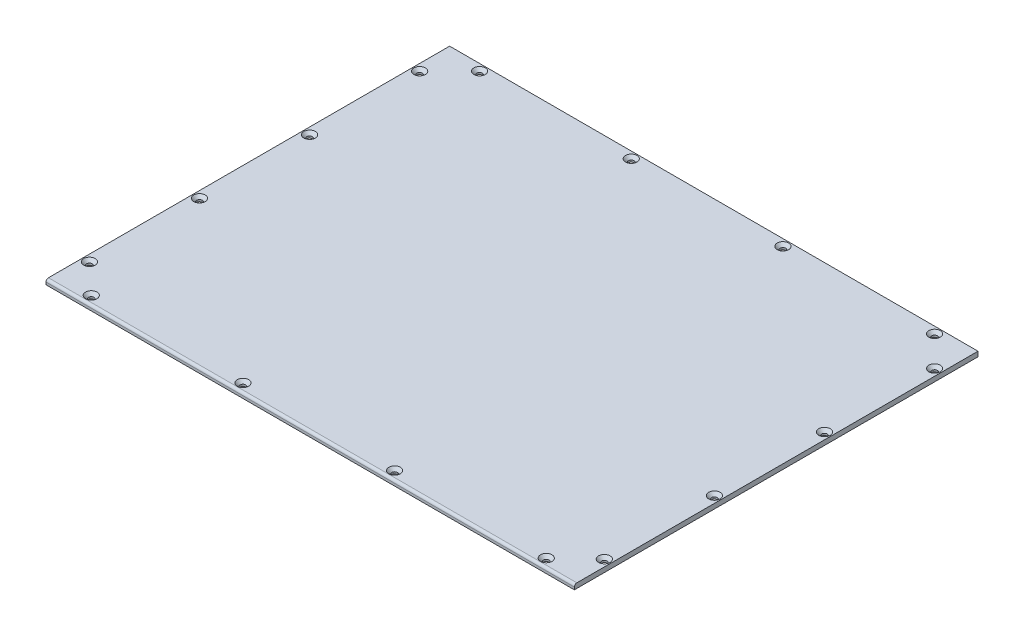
ISO-10303-21;
HEADER;
FILE_DESCRIPTION(('STEP AP214'),'2;1');
FILE_NAME('part.step','',(''),(''),'','','');
FILE_SCHEMA(('AUTOMOTIVE_DESIGN { 1 0 10303 214 1 1 1 1 }'));
ENDSEC;
DATA;
#1=APPLICATION_CONTEXT('core data for automotive mechanical design processes');
#2=APPLICATION_PROTOCOL_DEFINITION('international standard','automotive_design',2000,#1);
#3=PRODUCT_CONTEXT('',#1,'mechanical');
#4=PRODUCT('Part','Part','',(#3));
#5=PRODUCT_RELATED_PRODUCT_CATEGORY('part','',(#4));
#6=PRODUCT_DEFINITION_FORMATION('','',#4);
#7=PRODUCT_DEFINITION_CONTEXT('part definition',#1,'design');
#8=PRODUCT_DEFINITION('design','',#6,#7);
#9=PRODUCT_DEFINITION_SHAPE('','',#8);
#10=(LENGTH_UNIT() NAMED_UNIT(*) SI_UNIT(.MILLI.,.METRE.));
#11=(NAMED_UNIT(*) PLANE_ANGLE_UNIT() SI_UNIT($,.RADIAN.));
#12=(NAMED_UNIT(*) SI_UNIT($,.STERADIAN.) SOLID_ANGLE_UNIT());
#13=UNCERTAINTY_MEASURE_WITH_UNIT(LENGTH_MEASURE(1.E-05),#10,'distance_accuracy_value','');
#14=(GEOMETRIC_REPRESENTATION_CONTEXT(3) GLOBAL_UNCERTAINTY_ASSIGNED_CONTEXT((#13)) GLOBAL_UNIT_ASSIGNED_CONTEXT((#10,
#11,#12)) REPRESENTATION_CONTEXT('',''));
#15=CARTESIAN_POINT('',(0.,0.,0.));
#16=DIRECTION('',(0.,0.,1.));
#17=DIRECTION('',(1.,0.,0.));
#18=AXIS2_PLACEMENT_3D('',#15,#16,#17);
#19=CARTESIAN_POINT('',(0.,0.,0.));
#20=DIRECTION('',(0.,-1.,0.));
#21=DIRECTION('',(0.,0.,-1.));
#22=AXIS2_PLACEMENT_3D('',#19,#20,#21);
#23=PLANE('',#22);
#24=CARTESIAN_POINT('',(30.,0.,-324.5));
#25=DIRECTION('',(0.,1.,0.));
#26=DIRECTION('',(0.,0.,1.));
#27=AXIS2_PLACEMENT_3D('',#24,#25,#26);
#28=CIRCLE('',#27,2.25);
#29=CARTESIAN_POINT('',(30.,0.,-322.25));
#30=VERTEX_POINT('',#29);
#31=EDGE_CURVE('E262',#30,#30,#28,.T.);
#32=ORIENTED_EDGE('',*,*,#31,.T.);
#33=EDGE_LOOP('',(#32));
#34=FACE_BOUND('',#33,.T.);
#35=CARTESIAN_POINT('',(154.,0.,-324.5));
#36=DIRECTION('',(0.,1.,0.));
#37=DIRECTION('',(0.,0.,1.));
#38=AXIS2_PLACEMENT_3D('',#35,#36,#37);
#39=CIRCLE('',#38,2.25);
#40=CARTESIAN_POINT('',(154.,0.,-322.25));
#41=VERTEX_POINT('',#40);
#42=EDGE_CURVE('E253',#41,#41,#39,.T.);
#43=ORIENTED_EDGE('',*,*,#42,.T.);
#44=EDGE_LOOP('',(#43));
#45=FACE_BOUND('',#44,.T.);
#46=DIRECTION('',(0.,0.,1.));
#47=VECTOR('',#46,1.);
#48=CARTESIAN_POINT('',(0.,0.,0.));
#49=LINE('',#48,#47);
#50=CARTESIAN_POINT('',(0.,0.,-330.));
#51=VERTEX_POINT('',#50);
#52=CARTESIAN_POINT('',(0.,0.,0.));
#53=VERTEX_POINT('',#52);
#54=EDGE_CURVE('E105',#51,#53,#49,.T.);
#55=ORIENTED_EDGE('',*,*,#54,.F.);
#56=DIRECTION('',(-1.,0.,0.));
#57=VECTOR('',#56,1.);
#58=CARTESIAN_POINT('',(0.,0.,-330.));
#59=LINE('',#58,#57);
#60=CARTESIAN_POINT('',(432.,0.,-330.));
#61=VERTEX_POINT('',#60);
#62=EDGE_CURVE('E113',#61,#51,#59,.T.);
#63=ORIENTED_EDGE('',*,*,#62,.F.);
#64=DIRECTION('',(0.,0.,-1.));
#65=VECTOR('',#64,1.);
#66=CARTESIAN_POINT('',(432.,0.,0.));
#67=LINE('',#66,#65);
#68=CARTESIAN_POINT('',(432.,0.,0.));
#69=VERTEX_POINT('',#68);
#70=EDGE_CURVE('E92',#69,#61,#67,.T.);
#71=ORIENTED_EDGE('',*,*,#70,.F.);
#72=DIRECTION('',(1.,0.,0.));
#73=VECTOR('',#72,1.);
#74=CARTESIAN_POINT('',(0.,0.,0.));
#75=LINE('',#74,#73);
#76=EDGE_CURVE('E108',#53,#69,#75,.T.);
#77=ORIENTED_EDGE('',*,*,#76,.F.);
#78=EDGE_LOOP('',(#55,#63,#71,#77));
#79=FACE_BOUND('',#78,.T.);
#80=CARTESIAN_POINT('',(5.5,0.,-300.));
#81=DIRECTION('',(0.,1.,0.));
#82=DIRECTION('',(0.,0.,1.));
#83=AXIS2_PLACEMENT_3D('',#80,#81,#82);
#84=CIRCLE('',#83,2.25);
#85=CARTESIAN_POINT('',(5.5,0.,-297.75));
#86=VERTEX_POINT('',#85);
#87=EDGE_CURVE('E109',#86,#86,#84,.T.);
#88=ORIENTED_EDGE('',*,*,#87,.T.);
#89=EDGE_LOOP('',(#88));
#90=FACE_BOUND('',#89,.T.);
#91=CARTESIAN_POINT('',(5.5,0.,-210.));
#92=DIRECTION('',(0.,1.,0.));
#93=DIRECTION('',(0.,0.,1.));
#94=AXIS2_PLACEMENT_3D('',#91,#92,#93);
#95=CIRCLE('',#94,2.25);
#96=CARTESIAN_POINT('',(5.5,0.,-207.75));
#97=VERTEX_POINT('',#96);
#98=EDGE_CURVE('E136',#97,#97,#95,.T.);
#99=ORIENTED_EDGE('',*,*,#98,.T.);
#100=EDGE_LOOP('',(#99));
#101=FACE_BOUND('',#100,.T.);
#102=CARTESIAN_POINT('',(5.5,0.,-120.));
#103=DIRECTION('',(0.,1.,0.));
#104=DIRECTION('',(0.,0.,1.));
#105=AXIS2_PLACEMENT_3D('',#102,#103,#104);
#106=CIRCLE('',#105,2.25);
#107=CARTESIAN_POINT('',(5.5,0.,-117.75));
#108=VERTEX_POINT('',#107);
#109=EDGE_CURVE('E145',#108,#108,#106,.T.);
#110=ORIENTED_EDGE('',*,*,#109,.T.);
#111=EDGE_LOOP('',(#110));
#112=FACE_BOUND('',#111,.T.);
#113=CARTESIAN_POINT('',(5.5,0.,-30.0000000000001));
#114=DIRECTION('',(0.,1.,0.));
#115=DIRECTION('',(0.,0.,1.));
#116=AXIS2_PLACEMENT_3D('',#113,#114,#115);
#117=CIRCLE('',#116,2.25);
#118=CARTESIAN_POINT('',(5.5,0.,-27.7500000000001));
#119=VERTEX_POINT('',#118);
#120=EDGE_CURVE('E154',#119,#119,#117,.T.);
#121=ORIENTED_EDGE('',*,*,#120,.T.);
#122=EDGE_LOOP('',(#121));
#123=FACE_BOUND('',#122,.T.);
#124=CARTESIAN_POINT('',(30.,0.,-7.));
#125=DIRECTION('',(0.,1.,0.));
#126=DIRECTION('',(0.,0.,1.));
#127=AXIS2_PLACEMENT_3D('',#124,#125,#126);
#128=CIRCLE('',#127,2.25);
#129=CARTESIAN_POINT('',(30.,0.,-4.75));
#130=VERTEX_POINT('',#129);
#131=EDGE_CURVE('E163',#130,#130,#128,.T.);
#132=ORIENTED_EDGE('',*,*,#131,.T.);
#133=EDGE_LOOP('',(#132));
#134=FACE_BOUND('',#133,.T.);
#135=CARTESIAN_POINT('',(154.,0.,-7.));
#136=DIRECTION('',(0.,1.,0.));
#137=DIRECTION('',(0.,0.,1.));
#138=AXIS2_PLACEMENT_3D('',#135,#136,#137);
#139=CIRCLE('',#138,2.25);
#140=CARTESIAN_POINT('',(154.,0.,-4.75));
#141=VERTEX_POINT('',#140);
#142=EDGE_CURVE('E172',#141,#141,#139,.T.);
#143=ORIENTED_EDGE('',*,*,#142,.T.);
#144=EDGE_LOOP('',(#143));
#145=FACE_BOUND('',#144,.T.);
#146=CARTESIAN_POINT('',(278.,0.,-7.));
#147=DIRECTION('',(0.,1.,0.));
#148=DIRECTION('',(0.,0.,1.));
#149=AXIS2_PLACEMENT_3D('',#146,#147,#148);
#150=CIRCLE('',#149,2.24999999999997);
#151=CARTESIAN_POINT('',(278.,0.,-4.75000000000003));
#152=VERTEX_POINT('',#151);
#153=EDGE_CURVE('E181',#152,#152,#150,.T.);
#154=ORIENTED_EDGE('',*,*,#153,.T.);
#155=EDGE_LOOP('',(#154));
#156=FACE_BOUND('',#155,.T.);
#157=CARTESIAN_POINT('',(402.,0.,-7.));
#158=DIRECTION('',(0.,1.,0.));
#159=DIRECTION('',(0.,0.,1.));
#160=AXIS2_PLACEMENT_3D('',#157,#158,#159);
#161=CIRCLE('',#160,2.24999999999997);
#162=CARTESIAN_POINT('',(402.,0.,-4.75000000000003));
#163=VERTEX_POINT('',#162);
#164=EDGE_CURVE('E190',#163,#163,#161,.T.);
#165=ORIENTED_EDGE('',*,*,#164,.T.);
#166=EDGE_LOOP('',(#165));
#167=FACE_BOUND('',#166,.T.);
#168=CARTESIAN_POINT('',(426.5,0.,-30.0000000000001));
#169=DIRECTION('',(0.,1.,0.));
#170=DIRECTION('',(0.,0.,1.));
#171=AXIS2_PLACEMENT_3D('',#168,#169,#170);
#172=CIRCLE('',#171,2.24999999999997);
#173=CARTESIAN_POINT('',(426.5,0.,-27.7500000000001));
#174=VERTEX_POINT('',#173);
#175=EDGE_CURVE('E199',#174,#174,#172,.T.);
#176=ORIENTED_EDGE('',*,*,#175,.T.);
#177=EDGE_LOOP('',(#176));
#178=FACE_BOUND('',#177,.T.);
#179=CARTESIAN_POINT('',(426.5,0.,-120.));
#180=DIRECTION('',(0.,1.,0.));
#181=DIRECTION('',(0.,0.,1.));
#182=AXIS2_PLACEMENT_3D('',#179,#180,#181);
#183=CIRCLE('',#182,2.24999999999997);
#184=CARTESIAN_POINT('',(426.5,0.,-117.75));
#185=VERTEX_POINT('',#184);
#186=EDGE_CURVE('E208',#185,#185,#183,.T.);
#187=ORIENTED_EDGE('',*,*,#186,.T.);
#188=EDGE_LOOP('',(#187));
#189=FACE_BOUND('',#188,.T.);
#190=CARTESIAN_POINT('',(426.5,0.,-210.));
#191=DIRECTION('',(0.,1.,0.));
#192=DIRECTION('',(0.,0.,1.));
#193=AXIS2_PLACEMENT_3D('',#190,#191,#192);
#194=CIRCLE('',#193,2.24999999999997);
#195=CARTESIAN_POINT('',(426.5,0.,-207.75));
#196=VERTEX_POINT('',#195);
#197=EDGE_CURVE('E217',#196,#196,#194,.T.);
#198=ORIENTED_EDGE('',*,*,#197,.T.);
#199=EDGE_LOOP('',(#198));
#200=FACE_BOUND('',#199,.T.);
#201=CARTESIAN_POINT('',(426.5,0.,-300.));
#202=DIRECTION('',(0.,1.,0.));
#203=DIRECTION('',(0.,0.,1.));
#204=AXIS2_PLACEMENT_3D('',#201,#202,#203);
#205=CIRCLE('',#204,2.24999999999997);
#206=CARTESIAN_POINT('',(426.5,0.,-297.75));
#207=VERTEX_POINT('',#206);
#208=EDGE_CURVE('E226',#207,#207,#205,.T.);
#209=ORIENTED_EDGE('',*,*,#208,.T.);
#210=EDGE_LOOP('',(#209));
#211=FACE_BOUND('',#210,.T.);
#212=CARTESIAN_POINT('',(402.,0.,-324.5));
#213=DIRECTION('',(0.,1.,0.));
#214=DIRECTION('',(0.,0.,1.));
#215=AXIS2_PLACEMENT_3D('',#212,#213,#214);
#216=CIRCLE('',#215,2.24999999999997);
#217=CARTESIAN_POINT('',(402.,0.,-322.25));
#218=VERTEX_POINT('',#217);
#219=EDGE_CURVE('E235',#218,#218,#216,.T.);
#220=ORIENTED_EDGE('',*,*,#219,.T.);
#221=EDGE_LOOP('',(#220));
#222=FACE_BOUND('',#221,.T.);
#223=CARTESIAN_POINT('',(278.,0.,-324.5));
#224=DIRECTION('',(0.,1.,0.));
#225=DIRECTION('',(0.,0.,1.));
#226=AXIS2_PLACEMENT_3D('',#223,#224,#225);
#227=CIRCLE('',#226,2.24999999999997);
#228=CARTESIAN_POINT('',(278.,0.,-322.25));
#229=VERTEX_POINT('',#228);
#230=EDGE_CURVE('E244',#229,#229,#227,.T.);
#231=ORIENTED_EDGE('',*,*,#230,.T.);
#232=EDGE_LOOP('',(#231));
#233=FACE_BOUND('',#232,.T.);
#234=ADVANCED_FACE('F33',(#34,#45,#79,#90,#101,#112,#123,#134,#145,#156,#167,#178,#189,#200,
#211,#222,#233),#23,.T.);
#235=CARTESIAN_POINT('',(0.,4.,0.));
#236=DIRECTION('',(1.,0.,0.));
#237=DIRECTION('',(0.,0.,-1.));
#238=AXIS2_PLACEMENT_3D('',#235,#236,#237);
#239=PLANE('',#238);
#240=DIRECTION('',(0.,-1.,0.));
#241=VECTOR('',#240,1.);
#242=CARTESIAN_POINT('',(0.,4.,0.));
#243=LINE('',#242,#241);
#244=CARTESIAN_POINT('',(0.,2.,0.));
#245=VERTEX_POINT('',#244);
#246=EDGE_CURVE('E116',#245,#53,#243,.T.);
#247=ORIENTED_EDGE('',*,*,#246,.F.);
#248=CARTESIAN_POINT('',(0.,2.,-2.));
#249=DIRECTION('',(1.,0.,0.));
#250=DIRECTION('',(0.,0.,-1.));
#251=AXIS2_PLACEMENT_3D('',#248,#249,#250);
#252=CIRCLE('',#251,2.);
#253=CARTESIAN_POINT('',(0.,4.,-2.));
#254=VERTEX_POINT('',#253);
#255=EDGE_CURVE('E11',#245,#254,#252,.F.);
#256=ORIENTED_EDGE('',*,*,#255,.T.);
#257=DIRECTION('',(0.,0.,1.));
#258=VECTOR('',#257,1.);
#259=CARTESIAN_POINT('',(0.,4.,0.));
#260=LINE('',#259,#258);
#261=CARTESIAN_POINT('',(0.,4.,-330.));
#262=VERTEX_POINT('',#261);
#263=EDGE_CURVE('E86',#262,#254,#260,.T.);
#264=ORIENTED_EDGE('',*,*,#263,.F.);
#265=DIRECTION('',(0.,-1.,0.));
#266=VECTOR('',#265,1.);
#267=CARTESIAN_POINT('',(0.,4.,-330.));
#268=LINE('',#267,#266);
#269=EDGE_CURVE('E96',#262,#51,#268,.T.);
#270=ORIENTED_EDGE('',*,*,#269,.T.);
#271=ORIENTED_EDGE('',*,*,#54,.T.);
#272=EDGE_LOOP('',(#247,#256,#264,#270,#271));
#273=FACE_BOUND('',#272,.T.);
#274=ADVANCED_FACE('F126',(#273),#239,.F.);
#275=CARTESIAN_POINT('',(0.,4.,0.));
#276=DIRECTION('',(0.,0.,-1.));
#277=DIRECTION('',(-1.,0.,0.));
#278=AXIS2_PLACEMENT_3D('',#275,#276,#277);
#279=PLANE('',#278);
#280=DIRECTION('',(0.,-1.,0.));
#281=VECTOR('',#280,1.);
#282=CARTESIAN_POINT('',(432.,4.,0.));
#283=LINE('',#282,#281);
#284=CARTESIAN_POINT('',(432.,2.,0.));
#285=VERTEX_POINT('',#284);
#286=EDGE_CURVE('E95',#285,#69,#283,.T.);
#287=ORIENTED_EDGE('',*,*,#286,.F.);
#288=DIRECTION('',(1.,0.,0.));
#289=VECTOR('',#288,1.);
#290=CARTESIAN_POINT('',(0.,2.,0.));
#291=LINE('',#290,#289);
#292=EDGE_CURVE('E41',#285,#245,#291,.F.);
#293=ORIENTED_EDGE('',*,*,#292,.T.);
#294=ORIENTED_EDGE('',*,*,#246,.T.);
#295=ORIENTED_EDGE('',*,*,#76,.T.);
#296=EDGE_LOOP('',(#287,#293,#294,#295));
#297=FACE_BOUND('',#296,.T.);
#298=ADVANCED_FACE('F120',(#297),#279,.F.);
#299=CARTESIAN_POINT('',(432.,4.,0.));
#300=DIRECTION('',(-1.,0.,0.));
#301=DIRECTION('',(0.,0.,1.));
#302=AXIS2_PLACEMENT_3D('',#299,#300,#301);
#303=PLANE('',#302);
#304=DIRECTION('',(0.,0.,-1.));
#305=VECTOR('',#304,1.);
#306=CARTESIAN_POINT('',(432.,4.,0.));
#307=LINE('',#306,#305);
#308=CARTESIAN_POINT('',(432.,4.,-2.));
#309=VERTEX_POINT('',#308);
#310=CARTESIAN_POINT('',(432.,4.,-330.));
#311=VERTEX_POINT('',#310);
#312=EDGE_CURVE('E77',#309,#311,#307,.T.);
#313=ORIENTED_EDGE('',*,*,#312,.F.);
#314=CARTESIAN_POINT('',(432.,2.,-2.));
#315=DIRECTION('',(-1.,0.,0.));
#316=DIRECTION('',(0.,0.,1.));
#317=AXIS2_PLACEMENT_3D('',#314,#315,#316);
#318=CIRCLE('',#317,2.);
#319=EDGE_CURVE('E55',#309,#285,#318,.F.);
#320=ORIENTED_EDGE('',*,*,#319,.T.);
#321=ORIENTED_EDGE('',*,*,#286,.T.);
#322=ORIENTED_EDGE('',*,*,#70,.T.);
#323=DIRECTION('',(0.,-1.,0.));
#324=VECTOR('',#323,1.);
#325=CARTESIAN_POINT('',(432.,4.,-330.));
#326=LINE('',#325,#324);
#327=EDGE_CURVE('E89',#311,#61,#326,.T.);
#328=ORIENTED_EDGE('',*,*,#327,.F.);
#329=EDGE_LOOP('',(#313,#320,#321,#322,#328));
#330=FACE_BOUND('',#329,.T.);
#331=ADVANCED_FACE('F90',(#330),#303,.F.);
#332=CARTESIAN_POINT('',(0.,4.,-330.));
#333=DIRECTION('',(0.,0.,1.));
#334=DIRECTION('',(1.,0.,0.));
#335=AXIS2_PLACEMENT_3D('',#332,#333,#334);
#336=PLANE('',#335);
#337=ORIENTED_EDGE('',*,*,#62,.T.);
#338=ORIENTED_EDGE('',*,*,#269,.F.);
#339=DIRECTION('',(-1.,0.,0.));
#340=VECTOR('',#339,1.);
#341=CARTESIAN_POINT('',(0.,4.,-330.));
#342=LINE('',#341,#340);
#343=EDGE_CURVE('E82',#311,#262,#342,.T.);
#344=ORIENTED_EDGE('',*,*,#343,.F.);
#345=ORIENTED_EDGE('',*,*,#327,.T.);
#346=EDGE_LOOP('',(#337,#338,#344,#345));
#347=FACE_BOUND('',#346,.T.);
#348=ADVANCED_FACE('F98',(#347),#336,.F.);
#349=CARTESIAN_POINT('',(0.,4.,0.));
#350=DIRECTION('',(0.,-1.,0.));
#351=DIRECTION('',(0.,0.,-1.));
#352=AXIS2_PLACEMENT_3D('',#349,#350,#351);
#353=PLANE('',#352);
#354=CARTESIAN_POINT('',(30.,4.,-324.5));
#355=DIRECTION('',(0.,1.,0.));
#356=DIRECTION('',(0.,0.,1.));
#357=AXIS2_PLACEMENT_3D('',#354,#355,#356);
#358=CIRCLE('',#357,4.7);
#359=CARTESIAN_POINT('',(30.,4.,-319.8));
#360=VERTEX_POINT('',#359);
#361=EDGE_CURVE('E268',#360,#360,#358,.T.);
#362=ORIENTED_EDGE('',*,*,#361,.F.);
#363=EDGE_LOOP('',(#362));
#364=FACE_BOUND('',#363,.T.);
#365=CARTESIAN_POINT('',(154.,4.,-324.5));
#366=DIRECTION('',(0.,1.,0.));
#367=DIRECTION('',(0.,0.,1.));
#368=AXIS2_PLACEMENT_3D('',#365,#366,#367);
#369=CIRCLE('',#368,4.70000000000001);
#370=CARTESIAN_POINT('',(154.,4.,-319.8));
#371=VERTEX_POINT('',#370);
#372=EDGE_CURVE('E259',#371,#371,#369,.T.);
#373=ORIENTED_EDGE('',*,*,#372,.F.);
#374=EDGE_LOOP('',(#373));
#375=FACE_BOUND('',#374,.T.);
#376=CARTESIAN_POINT('',(278.,4.,-324.5));
#377=DIRECTION('',(0.,1.,0.));
#378=DIRECTION('',(0.,0.,1.));
#379=AXIS2_PLACEMENT_3D('',#376,#377,#378);
#380=CIRCLE('',#379,4.69999999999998);
#381=CARTESIAN_POINT('',(278.,4.,-319.8));
#382=VERTEX_POINT('',#381);
#383=EDGE_CURVE('E250',#382,#382,#380,.T.);
#384=ORIENTED_EDGE('',*,*,#383,.F.);
#385=EDGE_LOOP('',(#384));
#386=FACE_BOUND('',#385,.T.);
#387=CARTESIAN_POINT('',(402.,4.,-324.5));
#388=DIRECTION('',(0.,1.,0.));
#389=DIRECTION('',(0.,0.,1.));
#390=AXIS2_PLACEMENT_3D('',#387,#388,#389);
#391=CIRCLE('',#390,4.69999999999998);
#392=CARTESIAN_POINT('',(402.,4.,-319.8));
#393=VERTEX_POINT('',#392);
#394=EDGE_CURVE('E241',#393,#393,#391,.T.);
#395=ORIENTED_EDGE('',*,*,#394,.F.);
#396=EDGE_LOOP('',(#395));
#397=FACE_BOUND('',#396,.T.);
#398=CARTESIAN_POINT('',(426.5,4.,-300.));
#399=DIRECTION('',(0.,1.,0.));
#400=DIRECTION('',(0.,0.,1.));
#401=AXIS2_PLACEMENT_3D('',#398,#399,#400);
#402=CIRCLE('',#401,4.69999999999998);
#403=CARTESIAN_POINT('',(426.5,4.,-295.3));
#404=VERTEX_POINT('',#403);
#405=EDGE_CURVE('E232',#404,#404,#402,.T.);
#406=ORIENTED_EDGE('',*,*,#405,.F.);
#407=EDGE_LOOP('',(#406));
#408=FACE_BOUND('',#407,.T.);
#409=CARTESIAN_POINT('',(426.5,4.,-210.));
#410=DIRECTION('',(0.,1.,0.));
#411=DIRECTION('',(0.,0.,1.));
#412=AXIS2_PLACEMENT_3D('',#409,#410,#411);
#413=CIRCLE('',#412,4.69999999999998);
#414=CARTESIAN_POINT('',(426.5,4.,-205.3));
#415=VERTEX_POINT('',#414);
#416=EDGE_CURVE('E223',#415,#415,#413,.T.);
#417=ORIENTED_EDGE('',*,*,#416,.F.);
#418=EDGE_LOOP('',(#417));
#419=FACE_BOUND('',#418,.T.);
#420=CARTESIAN_POINT('',(426.5,4.,-120.));
#421=DIRECTION('',(0.,1.,0.));
#422=DIRECTION('',(0.,0.,1.));
#423=AXIS2_PLACEMENT_3D('',#420,#421,#422);
#424=CIRCLE('',#423,4.69999999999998);
#425=CARTESIAN_POINT('',(426.5,4.,-115.3));
#426=VERTEX_POINT('',#425);
#427=EDGE_CURVE('E214',#426,#426,#424,.T.);
#428=ORIENTED_EDGE('',*,*,#427,.F.);
#429=EDGE_LOOP('',(#428));
#430=FACE_BOUND('',#429,.T.);
#431=CARTESIAN_POINT('',(426.5,4.,-30.0000000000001));
#432=DIRECTION('',(0.,1.,0.));
#433=DIRECTION('',(0.,0.,1.));
#434=AXIS2_PLACEMENT_3D('',#431,#432,#433);
#435=CIRCLE('',#434,4.69999999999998);
#436=CARTESIAN_POINT('',(426.5,4.,-25.3000000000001));
#437=VERTEX_POINT('',#436);
#438=EDGE_CURVE('E205',#437,#437,#435,.T.);
#439=ORIENTED_EDGE('',*,*,#438,.F.);
#440=EDGE_LOOP('',(#439));
#441=FACE_BOUND('',#440,.T.);
#442=CARTESIAN_POINT('',(402.,4.,-7.));
#443=DIRECTION('',(0.,1.,0.));
#444=DIRECTION('',(0.,0.,1.));
#445=AXIS2_PLACEMENT_3D('',#442,#443,#444);
#446=CIRCLE('',#445,4.69999999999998);
#447=CARTESIAN_POINT('',(402.,4.,-2.30000000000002));
#448=VERTEX_POINT('',#447);
#449=EDGE_CURVE('E196',#448,#448,#446,.T.);
#450=ORIENTED_EDGE('',*,*,#449,.F.);
#451=EDGE_LOOP('',(#450));
#452=FACE_BOUND('',#451,.T.);
#453=CARTESIAN_POINT('',(278.,4.,-7.));
#454=DIRECTION('',(0.,1.,0.));
#455=DIRECTION('',(0.,0.,1.));
#456=AXIS2_PLACEMENT_3D('',#453,#454,#455);
#457=CIRCLE('',#456,4.69999999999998);
#458=CARTESIAN_POINT('',(278.,4.,-2.30000000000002));
#459=VERTEX_POINT('',#458);
#460=EDGE_CURVE('E187',#459,#459,#457,.T.);
#461=ORIENTED_EDGE('',*,*,#460,.F.);
#462=EDGE_LOOP('',(#461));
#463=FACE_BOUND('',#462,.T.);
#464=CARTESIAN_POINT('',(154.,4.,-7.));
#465=DIRECTION('',(0.,1.,0.));
#466=DIRECTION('',(0.,0.,1.));
#467=AXIS2_PLACEMENT_3D('',#464,#465,#466);
#468=CIRCLE('',#467,4.70000000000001);
#469=CARTESIAN_POINT('',(154.,4.,-2.29999999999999));
#470=VERTEX_POINT('',#469);
#471=EDGE_CURVE('E178',#470,#470,#468,.T.);
#472=ORIENTED_EDGE('',*,*,#471,.F.);
#473=EDGE_LOOP('',(#472));
#474=FACE_BOUND('',#473,.T.);
#475=CARTESIAN_POINT('',(30.,4.,-7.));
#476=DIRECTION('',(0.,1.,0.));
#477=DIRECTION('',(0.,0.,1.));
#478=AXIS2_PLACEMENT_3D('',#475,#476,#477);
#479=CIRCLE('',#478,4.7);
#480=CARTESIAN_POINT('',(30.,4.,-2.3));
#481=VERTEX_POINT('',#480);
#482=EDGE_CURVE('E169',#481,#481,#479,.T.);
#483=ORIENTED_EDGE('',*,*,#482,.F.);
#484=EDGE_LOOP('',(#483));
#485=FACE_BOUND('',#484,.T.);
#486=CARTESIAN_POINT('',(5.5,4.,-30.0000000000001));
#487=DIRECTION('',(0.,1.,0.));
#488=DIRECTION('',(0.,0.,1.));
#489=AXIS2_PLACEMENT_3D('',#486,#487,#488);
#490=CIRCLE('',#489,4.7);
#491=CARTESIAN_POINT('',(5.5,4.,-25.3000000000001));
#492=VERTEX_POINT('',#491);
#493=EDGE_CURVE('E160',#492,#492,#490,.T.);
#494=ORIENTED_EDGE('',*,*,#493,.F.);
#495=EDGE_LOOP('',(#494));
#496=FACE_BOUND('',#495,.T.);
#497=CARTESIAN_POINT('',(5.5,4.,-120.));
#498=DIRECTION('',(0.,1.,0.));
#499=DIRECTION('',(0.,0.,1.));
#500=AXIS2_PLACEMENT_3D('',#497,#498,#499);
#501=CIRCLE('',#500,4.7);
#502=CARTESIAN_POINT('',(5.5,4.,-115.3));
#503=VERTEX_POINT('',#502);
#504=EDGE_CURVE('E151',#503,#503,#501,.T.);
#505=ORIENTED_EDGE('',*,*,#504,.F.);
#506=EDGE_LOOP('',(#505));
#507=FACE_BOUND('',#506,.T.);
#508=CARTESIAN_POINT('',(5.5,4.,-210.));
#509=DIRECTION('',(0.,1.,0.));
#510=DIRECTION('',(0.,0.,1.));
#511=AXIS2_PLACEMENT_3D('',#508,#509,#510);
#512=CIRCLE('',#511,4.7);
#513=CARTESIAN_POINT('',(5.5,4.,-205.3));
#514=VERTEX_POINT('',#513);
#515=EDGE_CURVE('E142',#514,#514,#512,.T.);
#516=ORIENTED_EDGE('',*,*,#515,.F.);
#517=EDGE_LOOP('',(#516));
#518=FACE_BOUND('',#517,.T.);
#519=CARTESIAN_POINT('',(5.5,4.,-300.));
#520=DIRECTION('',(0.,1.,0.));
#521=DIRECTION('',(0.,0.,1.));
#522=AXIS2_PLACEMENT_3D('',#519,#520,#521);
#523=CIRCLE('',#522,4.7);
#524=CARTESIAN_POINT('',(5.5,4.,-295.3));
#525=VERTEX_POINT('',#524);
#526=EDGE_CURVE('E133',#525,#525,#523,.T.);
#527=ORIENTED_EDGE('',*,*,#526,.F.);
#528=EDGE_LOOP('',(#527));
#529=FACE_BOUND('',#528,.T.);
#530=ORIENTED_EDGE('',*,*,#263,.T.);
#531=DIRECTION('',(1.,0.,0.));
#532=VECTOR('',#531,1.);
#533=CARTESIAN_POINT('',(0.,4.,-2.));
#534=LINE('',#533,#532);
#535=EDGE_CURVE('E85',#254,#309,#534,.T.);
#536=ORIENTED_EDGE('',*,*,#535,.T.);
#537=ORIENTED_EDGE('',*,*,#312,.T.);
#538=ORIENTED_EDGE('',*,*,#343,.T.);
#539=EDGE_LOOP('',(#530,#536,#537,#538));
#540=FACE_BOUND('',#539,.T.);
#541=ADVANCED_FACE('F80',(#364,#375,#386,#397,#408,#419,#430,#441,#452,#463,#474,#485,#496,#507,
#518,#529,#540),#353,.F.);
#542=CARTESIAN_POINT('',(0.,2.,-2.));
#543=DIRECTION('',(1.,0.,0.));
#544=DIRECTION('',(0.,0.,-1.));
#545=AXIS2_PLACEMENT_3D('',#542,#543,#544);
#546=CYLINDRICAL_SURFACE('',#545,2.);
#547=ORIENTED_EDGE('',*,*,#255,.F.);
#548=ORIENTED_EDGE('',*,*,#292,.F.);
#549=ORIENTED_EDGE('',*,*,#319,.F.);
#550=ORIENTED_EDGE('',*,*,#535,.F.);
#551=EDGE_LOOP('',(#547,#548,#549,#550));
#552=FACE_BOUND('',#551,.T.);
#553=ADVANCED_FACE('F35',(#552),#546,.T.);
#554=CARTESIAN_POINT('',(5.5,4.,-300.));
#555=DIRECTION('',(0.,1.,0.));
#556=DIRECTION('',(0.,0.,1.));
#557=AXIS2_PLACEMENT_3D('',#554,#555,#556);
#558=CYLINDRICAL_SURFACE('',#557,2.25);
#559=ORIENTED_EDGE('',*,*,#87,.F.);
#560=EDGE_LOOP('',(#559));
#561=FACE_BOUND('',#560,.T.);
#562=CARTESIAN_POINT('',(5.5,1.55,-300.));
#563=DIRECTION('',(0.,1.,0.));
#564=DIRECTION('',(0.,0.,1.));
#565=AXIS2_PLACEMENT_3D('',#562,#563,#564);
#566=CIRCLE('',#565,2.25);
#567=CARTESIAN_POINT('',(5.5,1.55,-297.75));
#568=VERTEX_POINT('',#567);
#569=EDGE_CURVE('E130',#568,#568,#566,.T.);
#570=ORIENTED_EDGE('',*,*,#569,.T.);
#571=EDGE_LOOP('',(#570));
#572=FACE_BOUND('',#571,.T.);
#573=ADVANCED_FACE('F310',(#561,#572),#558,.F.);
#574=CARTESIAN_POINT('',(5.5,4.,-300.));
#575=DIRECTION('',(0.,1.,0.));
#576=DIRECTION('',(0.,0.,1.));
#577=AXIS2_PLACEMENT_3D('',#574,#575,#576);
#578=CONICAL_SURFACE('',#577,4.7,0.785398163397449);
#579=ORIENTED_EDGE('',*,*,#569,.F.);
#580=EDGE_LOOP('',(#579));
#581=FACE_BOUND('',#580,.T.);
#582=ORIENTED_EDGE('',*,*,#526,.T.);
#583=EDGE_LOOP('',(#582));
#584=FACE_BOUND('',#583,.T.);
#585=ADVANCED_FACE('F307',(#581,#584),#578,.F.);
#586=CARTESIAN_POINT('',(5.5,4.,-210.));
#587=DIRECTION('',(0.,1.,0.));
#588=DIRECTION('',(0.,0.,1.));
#589=AXIS2_PLACEMENT_3D('',#586,#587,#588);
#590=CYLINDRICAL_SURFACE('',#589,2.25);
#591=ORIENTED_EDGE('',*,*,#98,.F.);
#592=EDGE_LOOP('',(#591));
#593=FACE_BOUND('',#592,.T.);
#594=CARTESIAN_POINT('',(5.5,1.55,-210.));
#595=DIRECTION('',(0.,1.,0.));
#596=DIRECTION('',(0.,0.,1.));
#597=AXIS2_PLACEMENT_3D('',#594,#595,#596);
#598=CIRCLE('',#597,2.25);
#599=CARTESIAN_POINT('',(5.5,1.55,-207.75));
#600=VERTEX_POINT('',#599);
#601=EDGE_CURVE('E139',#600,#600,#598,.T.);
#602=ORIENTED_EDGE('',*,*,#601,.T.);
#603=EDGE_LOOP('',(#602));
#604=FACE_BOUND('',#603,.T.);
#605=ADVANCED_FACE('F309',(#593,#604),#590,.F.);
#606=CARTESIAN_POINT('',(5.5,4.,-210.));
#607=DIRECTION('',(0.,1.,0.));
#608=DIRECTION('',(0.,0.,1.));
#609=AXIS2_PLACEMENT_3D('',#606,#607,#608);
#610=CONICAL_SURFACE('',#609,4.7,0.785398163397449);
#611=ORIENTED_EDGE('',*,*,#601,.F.);
#612=EDGE_LOOP('',(#611));
#613=FACE_BOUND('',#612,.T.);
#614=ORIENTED_EDGE('',*,*,#515,.T.);
#615=EDGE_LOOP('',(#614));
#616=FACE_BOUND('',#615,.T.);
#617=ADVANCED_FACE('F317',(#613,#616),#610,.F.);
#618=CARTESIAN_POINT('',(5.5,4.,-120.));
#619=DIRECTION('',(0.,1.,0.));
#620=DIRECTION('',(0.,0.,1.));
#621=AXIS2_PLACEMENT_3D('',#618,#619,#620);
#622=CYLINDRICAL_SURFACE('',#621,2.25);
#623=ORIENTED_EDGE('',*,*,#109,.F.);
#624=EDGE_LOOP('',(#623));
#625=FACE_BOUND('',#624,.T.);
#626=CARTESIAN_POINT('',(5.5,1.55,-120.));
#627=DIRECTION('',(0.,1.,0.));
#628=DIRECTION('',(0.,0.,1.));
#629=AXIS2_PLACEMENT_3D('',#626,#627,#628);
#630=CIRCLE('',#629,2.25);
#631=CARTESIAN_POINT('',(5.5,1.55,-117.75));
#632=VERTEX_POINT('',#631);
#633=EDGE_CURVE('E148',#632,#632,#630,.T.);
#634=ORIENTED_EDGE('',*,*,#633,.T.);
#635=EDGE_LOOP('',(#634));
#636=FACE_BOUND('',#635,.T.);
#637=ADVANCED_FACE('F382',(#625,#636),#622,.F.);
#638=CARTESIAN_POINT('',(5.5,4.,-120.));
#639=DIRECTION('',(0.,1.,0.));
#640=DIRECTION('',(0.,0.,1.));
#641=AXIS2_PLACEMENT_3D('',#638,#639,#640);
#642=CONICAL_SURFACE('',#641,4.7,0.785398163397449);
#643=ORIENTED_EDGE('',*,*,#633,.F.);
#644=EDGE_LOOP('',(#643));
#645=FACE_BOUND('',#644,.T.);
#646=ORIENTED_EDGE('',*,*,#504,.T.);
#647=EDGE_LOOP('',(#646));
#648=FACE_BOUND('',#647,.T.);
#649=ADVANCED_FACE('F392',(#645,#648),#642,.F.);
#650=CARTESIAN_POINT('',(5.5,4.,-30.0000000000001));
#651=DIRECTION('',(0.,1.,0.));
#652=DIRECTION('',(0.,0.,1.));
#653=AXIS2_PLACEMENT_3D('',#650,#651,#652);
#654=CYLINDRICAL_SURFACE('',#653,2.25);
#655=ORIENTED_EDGE('',*,*,#120,.F.);
#656=EDGE_LOOP('',(#655));
#657=FACE_BOUND('',#656,.T.);
#658=CARTESIAN_POINT('',(5.5,1.55,-30.0000000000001));
#659=DIRECTION('',(0.,1.,0.));
#660=DIRECTION('',(0.,0.,1.));
#661=AXIS2_PLACEMENT_3D('',#658,#659,#660);
#662=CIRCLE('',#661,2.25);
#663=CARTESIAN_POINT('',(5.5,1.55,-27.7500000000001));
#664=VERTEX_POINT('',#663);
#665=EDGE_CURVE('E157',#664,#664,#662,.T.);
#666=ORIENTED_EDGE('',*,*,#665,.T.);
#667=EDGE_LOOP('',(#666));
#668=FACE_BOUND('',#667,.T.);
#669=ADVANCED_FACE('F402',(#657,#668),#654,.F.);
#670=CARTESIAN_POINT('',(5.5,4.,-30.0000000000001));
#671=DIRECTION('',(0.,1.,0.));
#672=DIRECTION('',(0.,0.,1.));
#673=AXIS2_PLACEMENT_3D('',#670,#671,#672);
#674=CONICAL_SURFACE('',#673,4.7,0.785398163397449);
#675=ORIENTED_EDGE('',*,*,#665,.F.);
#676=EDGE_LOOP('',(#675));
#677=FACE_BOUND('',#676,.T.);
#678=ORIENTED_EDGE('',*,*,#493,.T.);
#679=EDGE_LOOP('',(#678));
#680=FACE_BOUND('',#679,.T.);
#681=ADVANCED_FACE('F412',(#677,#680),#674,.F.);
#682=CARTESIAN_POINT('',(30.,4.,-7.));
#683=DIRECTION('',(0.,1.,0.));
#684=DIRECTION('',(0.,0.,1.));
#685=AXIS2_PLACEMENT_3D('',#682,#683,#684);
#686=CYLINDRICAL_SURFACE('',#685,2.25);
#687=ORIENTED_EDGE('',*,*,#131,.F.);
#688=EDGE_LOOP('',(#687));
#689=FACE_BOUND('',#688,.T.);
#690=CARTESIAN_POINT('',(30.,1.55,-7.));
#691=DIRECTION('',(0.,1.,0.));
#692=DIRECTION('',(0.,0.,1.));
#693=AXIS2_PLACEMENT_3D('',#690,#691,#692);
#694=CIRCLE('',#693,2.25);
#695=CARTESIAN_POINT('',(30.,1.55,-4.75));
#696=VERTEX_POINT('',#695);
#697=EDGE_CURVE('E166',#696,#696,#694,.T.);
#698=ORIENTED_EDGE('',*,*,#697,.T.);
#699=EDGE_LOOP('',(#698));
#700=FACE_BOUND('',#699,.T.);
#701=ADVANCED_FACE('F422',(#689,#700),#686,.F.);
#702=CARTESIAN_POINT('',(30.,4.,-7.));
#703=DIRECTION('',(0.,1.,0.));
#704=DIRECTION('',(0.,0.,1.));
#705=AXIS2_PLACEMENT_3D('',#702,#703,#704);
#706=CONICAL_SURFACE('',#705,4.7,0.785398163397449);
#707=ORIENTED_EDGE('',*,*,#697,.F.);
#708=EDGE_LOOP('',(#707));
#709=FACE_BOUND('',#708,.T.);
#710=ORIENTED_EDGE('',*,*,#482,.T.);
#711=EDGE_LOOP('',(#710));
#712=FACE_BOUND('',#711,.T.);
#713=ADVANCED_FACE('F432',(#709,#712),#706,.F.);
#714=CARTESIAN_POINT('',(154.,4.,-7.));
#715=DIRECTION('',(0.,1.,0.));
#716=DIRECTION('',(0.,0.,1.));
#717=AXIS2_PLACEMENT_3D('',#714,#715,#716);
#718=CYLINDRICAL_SURFACE('',#717,2.25);
#719=ORIENTED_EDGE('',*,*,#142,.F.);
#720=EDGE_LOOP('',(#719));
#721=FACE_BOUND('',#720,.T.);
#722=CARTESIAN_POINT('',(154.,1.55,-7.));
#723=DIRECTION('',(0.,1.,0.));
#724=DIRECTION('',(0.,0.,1.));
#725=AXIS2_PLACEMENT_3D('',#722,#723,#724);
#726=CIRCLE('',#725,2.25);
#727=CARTESIAN_POINT('',(154.,1.55,-4.75));
#728=VERTEX_POINT('',#727);
#729=EDGE_CURVE('E175',#728,#728,#726,.T.);
#730=ORIENTED_EDGE('',*,*,#729,.T.);
#731=EDGE_LOOP('',(#730));
#732=FACE_BOUND('',#731,.T.);
#733=ADVANCED_FACE('F442',(#721,#732),#718,.F.);
#734=CARTESIAN_POINT('',(154.,4.,-7.));
#735=DIRECTION('',(0.,1.,0.));
#736=DIRECTION('',(0.,0.,1.));
#737=AXIS2_PLACEMENT_3D('',#734,#735,#736);
#738=CONICAL_SURFACE('',#737,4.70000000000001,0.78539816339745);
#739=ORIENTED_EDGE('',*,*,#729,.F.);
#740=EDGE_LOOP('',(#739));
#741=FACE_BOUND('',#740,.T.);
#742=ORIENTED_EDGE('',*,*,#471,.T.);
#743=EDGE_LOOP('',(#742));
#744=FACE_BOUND('',#743,.T.);
#745=ADVANCED_FACE('F452',(#741,#744),#738,.F.);
#746=CARTESIAN_POINT('',(278.,4.,-7.));
#747=DIRECTION('',(0.,1.,0.));
#748=DIRECTION('',(0.,0.,1.));
#749=AXIS2_PLACEMENT_3D('',#746,#747,#748);
#750=CYLINDRICAL_SURFACE('',#749,2.24999999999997);
#751=ORIENTED_EDGE('',*,*,#153,.F.);
#752=EDGE_LOOP('',(#751));
#753=FACE_BOUND('',#752,.T.);
#754=CARTESIAN_POINT('',(278.,1.55,-7.));
#755=DIRECTION('',(0.,1.,0.));
#756=DIRECTION('',(0.,0.,1.));
#757=AXIS2_PLACEMENT_3D('',#754,#755,#756);
#758=CIRCLE('',#757,2.24999999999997);
#759=CARTESIAN_POINT('',(278.,1.55,-4.75000000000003));
#760=VERTEX_POINT('',#759);
#761=EDGE_CURVE('E184',#760,#760,#758,.T.);
#762=ORIENTED_EDGE('',*,*,#761,.T.);
#763=EDGE_LOOP('',(#762));
#764=FACE_BOUND('',#763,.T.);
#765=ADVANCED_FACE('F462',(#753,#764),#750,.F.);
#766=CARTESIAN_POINT('',(278.,4.,-7.));
#767=DIRECTION('',(0.,1.,0.));
#768=DIRECTION('',(0.,0.,1.));
#769=AXIS2_PLACEMENT_3D('',#766,#767,#768);
#770=CONICAL_SURFACE('',#769,4.69999999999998,0.78539816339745);
#771=ORIENTED_EDGE('',*,*,#761,.F.);
#772=EDGE_LOOP('',(#771));
#773=FACE_BOUND('',#772,.T.);
#774=ORIENTED_EDGE('',*,*,#460,.T.);
#775=EDGE_LOOP('',(#774));
#776=FACE_BOUND('',#775,.T.);
#777=ADVANCED_FACE('F472',(#773,#776),#770,.F.);
#778=CARTESIAN_POINT('',(402.,4.,-7.));
#779=DIRECTION('',(0.,1.,0.));
#780=DIRECTION('',(0.,0.,1.));
#781=AXIS2_PLACEMENT_3D('',#778,#779,#780);
#782=CYLINDRICAL_SURFACE('',#781,2.24999999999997);
#783=ORIENTED_EDGE('',*,*,#164,.F.);
#784=EDGE_LOOP('',(#783));
#785=FACE_BOUND('',#784,.T.);
#786=CARTESIAN_POINT('',(402.,1.55,-7.));
#787=DIRECTION('',(0.,1.,0.));
#788=DIRECTION('',(0.,0.,1.));
#789=AXIS2_PLACEMENT_3D('',#786,#787,#788);
#790=CIRCLE('',#789,2.24999999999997);
#791=CARTESIAN_POINT('',(402.,1.55,-4.75000000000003));
#792=VERTEX_POINT('',#791);
#793=EDGE_CURVE('E193',#792,#792,#790,.T.);
#794=ORIENTED_EDGE('',*,*,#793,.T.);
#795=EDGE_LOOP('',(#794));
#796=FACE_BOUND('',#795,.T.);
#797=ADVANCED_FACE('F482',(#785,#796),#782,.F.);
#798=CARTESIAN_POINT('',(402.,4.,-7.));
#799=DIRECTION('',(0.,1.,0.));
#800=DIRECTION('',(0.,0.,1.));
#801=AXIS2_PLACEMENT_3D('',#798,#799,#800);
#802=CONICAL_SURFACE('',#801,4.69999999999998,0.78539816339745);
#803=ORIENTED_EDGE('',*,*,#793,.F.);
#804=EDGE_LOOP('',(#803));
#805=FACE_BOUND('',#804,.T.);
#806=ORIENTED_EDGE('',*,*,#449,.T.);
#807=EDGE_LOOP('',(#806));
#808=FACE_BOUND('',#807,.T.);
#809=ADVANCED_FACE('F492',(#805,#808),#802,.F.);
#810=CARTESIAN_POINT('',(426.5,4.,-30.0000000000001));
#811=DIRECTION('',(0.,1.,0.));
#812=DIRECTION('',(0.,0.,1.));
#813=AXIS2_PLACEMENT_3D('',#810,#811,#812);
#814=CYLINDRICAL_SURFACE('',#813,2.24999999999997);
#815=ORIENTED_EDGE('',*,*,#175,.F.);
#816=EDGE_LOOP('',(#815));
#817=FACE_BOUND('',#816,.T.);
#818=CARTESIAN_POINT('',(426.5,1.55,-30.0000000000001));
#819=DIRECTION('',(0.,1.,0.));
#820=DIRECTION('',(0.,0.,1.));
#821=AXIS2_PLACEMENT_3D('',#818,#819,#820);
#822=CIRCLE('',#821,2.24999999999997);
#823=CARTESIAN_POINT('',(426.5,1.55,-27.7500000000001));
#824=VERTEX_POINT('',#823);
#825=EDGE_CURVE('E202',#824,#824,#822,.T.);
#826=ORIENTED_EDGE('',*,*,#825,.T.);
#827=EDGE_LOOP('',(#826));
#828=FACE_BOUND('',#827,.T.);
#829=ADVANCED_FACE('F502',(#817,#828),#814,.F.);
#830=CARTESIAN_POINT('',(426.5,4.,-30.0000000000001));
#831=DIRECTION('',(0.,1.,0.));
#832=DIRECTION('',(0.,0.,1.));
#833=AXIS2_PLACEMENT_3D('',#830,#831,#832);
#834=CONICAL_SURFACE('',#833,4.69999999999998,0.78539816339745);
#835=ORIENTED_EDGE('',*,*,#825,.F.);
#836=EDGE_LOOP('',(#835));
#837=FACE_BOUND('',#836,.T.);
#838=ORIENTED_EDGE('',*,*,#438,.T.);
#839=EDGE_LOOP('',(#838));
#840=FACE_BOUND('',#839,.T.);
#841=ADVANCED_FACE('F512',(#837,#840),#834,.F.);
#842=CARTESIAN_POINT('',(426.5,4.,-120.));
#843=DIRECTION('',(0.,1.,0.));
#844=DIRECTION('',(0.,0.,1.));
#845=AXIS2_PLACEMENT_3D('',#842,#843,#844);
#846=CYLINDRICAL_SURFACE('',#845,2.24999999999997);
#847=ORIENTED_EDGE('',*,*,#186,.F.);
#848=EDGE_LOOP('',(#847));
#849=FACE_BOUND('',#848,.T.);
#850=CARTESIAN_POINT('',(426.5,1.55,-120.));
#851=DIRECTION('',(0.,1.,0.));
#852=DIRECTION('',(0.,0.,1.));
#853=AXIS2_PLACEMENT_3D('',#850,#851,#852);
#854=CIRCLE('',#853,2.24999999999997);
#855=CARTESIAN_POINT('',(426.5,1.55,-117.75));
#856=VERTEX_POINT('',#855);
#857=EDGE_CURVE('E211',#856,#856,#854,.T.);
#858=ORIENTED_EDGE('',*,*,#857,.T.);
#859=EDGE_LOOP('',(#858));
#860=FACE_BOUND('',#859,.T.);
#861=ADVANCED_FACE('F522',(#849,#860),#846,.F.);
#862=CARTESIAN_POINT('',(426.5,4.,-120.));
#863=DIRECTION('',(0.,1.,0.));
#864=DIRECTION('',(0.,0.,1.));
#865=AXIS2_PLACEMENT_3D('',#862,#863,#864);
#866=CONICAL_SURFACE('',#865,4.69999999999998,0.78539816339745);
#867=ORIENTED_EDGE('',*,*,#857,.F.);
#868=EDGE_LOOP('',(#867));
#869=FACE_BOUND('',#868,.T.);
#870=ORIENTED_EDGE('',*,*,#427,.T.);
#871=EDGE_LOOP('',(#870));
#872=FACE_BOUND('',#871,.T.);
#873=ADVANCED_FACE('F532',(#869,#872),#866,.F.);
#874=CARTESIAN_POINT('',(426.5,4.,-210.));
#875=DIRECTION('',(0.,1.,0.));
#876=DIRECTION('',(0.,0.,1.));
#877=AXIS2_PLACEMENT_3D('',#874,#875,#876);
#878=CYLINDRICAL_SURFACE('',#877,2.24999999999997);
#879=ORIENTED_EDGE('',*,*,#197,.F.);
#880=EDGE_LOOP('',(#879));
#881=FACE_BOUND('',#880,.T.);
#882=CARTESIAN_POINT('',(426.5,1.55,-210.));
#883=DIRECTION('',(0.,1.,0.));
#884=DIRECTION('',(0.,0.,1.));
#885=AXIS2_PLACEMENT_3D('',#882,#883,#884);
#886=CIRCLE('',#885,2.24999999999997);
#887=CARTESIAN_POINT('',(426.5,1.55,-207.75));
#888=VERTEX_POINT('',#887);
#889=EDGE_CURVE('E220',#888,#888,#886,.T.);
#890=ORIENTED_EDGE('',*,*,#889,.T.);
#891=EDGE_LOOP('',(#890));
#892=FACE_BOUND('',#891,.T.);
#893=ADVANCED_FACE('F542',(#881,#892),#878,.F.);
#894=CARTESIAN_POINT('',(426.5,4.,-210.));
#895=DIRECTION('',(0.,1.,0.));
#896=DIRECTION('',(0.,0.,1.));
#897=AXIS2_PLACEMENT_3D('',#894,#895,#896);
#898=CONICAL_SURFACE('',#897,4.69999999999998,0.78539816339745);
#899=ORIENTED_EDGE('',*,*,#889,.F.);
#900=EDGE_LOOP('',(#899));
#901=FACE_BOUND('',#900,.T.);
#902=ORIENTED_EDGE('',*,*,#416,.T.);
#903=EDGE_LOOP('',(#902));
#904=FACE_BOUND('',#903,.T.);
#905=ADVANCED_FACE('F552',(#901,#904),#898,.F.);
#906=CARTESIAN_POINT('',(426.5,4.,-300.));
#907=DIRECTION('',(0.,1.,0.));
#908=DIRECTION('',(0.,0.,1.));
#909=AXIS2_PLACEMENT_3D('',#906,#907,#908);
#910=CYLINDRICAL_SURFACE('',#909,2.24999999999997);
#911=ORIENTED_EDGE('',*,*,#208,.F.);
#912=EDGE_LOOP('',(#911));
#913=FACE_BOUND('',#912,.T.);
#914=CARTESIAN_POINT('',(426.5,1.55,-300.));
#915=DIRECTION('',(0.,1.,0.));
#916=DIRECTION('',(0.,0.,1.));
#917=AXIS2_PLACEMENT_3D('',#914,#915,#916);
#918=CIRCLE('',#917,2.24999999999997);
#919=CARTESIAN_POINT('',(426.5,1.55,-297.75));
#920=VERTEX_POINT('',#919);
#921=EDGE_CURVE('E229',#920,#920,#918,.T.);
#922=ORIENTED_EDGE('',*,*,#921,.T.);
#923=EDGE_LOOP('',(#922));
#924=FACE_BOUND('',#923,.T.);
#925=ADVANCED_FACE('F562',(#913,#924),#910,.F.);
#926=CARTESIAN_POINT('',(426.5,4.,-300.));
#927=DIRECTION('',(0.,1.,0.));
#928=DIRECTION('',(0.,0.,1.));
#929=AXIS2_PLACEMENT_3D('',#926,#927,#928);
#930=CONICAL_SURFACE('',#929,4.69999999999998,0.78539816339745);
#931=ORIENTED_EDGE('',*,*,#921,.F.);
#932=EDGE_LOOP('',(#931));
#933=FACE_BOUND('',#932,.T.);
#934=ORIENTED_EDGE('',*,*,#405,.T.);
#935=EDGE_LOOP('',(#934));
#936=FACE_BOUND('',#935,.T.);
#937=ADVANCED_FACE('F572',(#933,#936),#930,.F.);
#938=CARTESIAN_POINT('',(402.,4.,-324.5));
#939=DIRECTION('',(0.,1.,0.));
#940=DIRECTION('',(0.,0.,1.));
#941=AXIS2_PLACEMENT_3D('',#938,#939,#940);
#942=CYLINDRICAL_SURFACE('',#941,2.24999999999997);
#943=ORIENTED_EDGE('',*,*,#219,.F.);
#944=EDGE_LOOP('',(#943));
#945=FACE_BOUND('',#944,.T.);
#946=CARTESIAN_POINT('',(402.,1.55,-324.5));
#947=DIRECTION('',(0.,1.,0.));
#948=DIRECTION('',(0.,0.,1.));
#949=AXIS2_PLACEMENT_3D('',#946,#947,#948);
#950=CIRCLE('',#949,2.24999999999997);
#951=CARTESIAN_POINT('',(402.,1.55,-322.25));
#952=VERTEX_POINT('',#951);
#953=EDGE_CURVE('E238',#952,#952,#950,.T.);
#954=ORIENTED_EDGE('',*,*,#953,.T.);
#955=EDGE_LOOP('',(#954));
#956=FACE_BOUND('',#955,.T.);
#957=ADVANCED_FACE('F582',(#945,#956),#942,.F.);
#958=CARTESIAN_POINT('',(402.,4.,-324.5));
#959=DIRECTION('',(0.,1.,0.));
#960=DIRECTION('',(0.,0.,1.));
#961=AXIS2_PLACEMENT_3D('',#958,#959,#960);
#962=CONICAL_SURFACE('',#961,4.69999999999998,0.78539816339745);
#963=ORIENTED_EDGE('',*,*,#953,.F.);
#964=EDGE_LOOP('',(#963));
#965=FACE_BOUND('',#964,.T.);
#966=ORIENTED_EDGE('',*,*,#394,.T.);
#967=EDGE_LOOP('',(#966));
#968=FACE_BOUND('',#967,.T.);
#969=ADVANCED_FACE('F592',(#965,#968),#962,.F.);
#970=CARTESIAN_POINT('',(278.,4.,-324.5));
#971=DIRECTION('',(0.,1.,0.));
#972=DIRECTION('',(0.,0.,1.));
#973=AXIS2_PLACEMENT_3D('',#970,#971,#972);
#974=CYLINDRICAL_SURFACE('',#973,2.24999999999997);
#975=ORIENTED_EDGE('',*,*,#230,.F.);
#976=EDGE_LOOP('',(#975));
#977=FACE_BOUND('',#976,.T.);
#978=CARTESIAN_POINT('',(278.,1.55,-324.5));
#979=DIRECTION('',(0.,1.,0.));
#980=DIRECTION('',(0.,0.,1.));
#981=AXIS2_PLACEMENT_3D('',#978,#979,#980);
#982=CIRCLE('',#981,2.24999999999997);
#983=CARTESIAN_POINT('',(278.,1.55,-322.25));
#984=VERTEX_POINT('',#983);
#985=EDGE_CURVE('E247',#984,#984,#982,.T.);
#986=ORIENTED_EDGE('',*,*,#985,.T.);
#987=EDGE_LOOP('',(#986));
#988=FACE_BOUND('',#987,.T.);
#989=ADVANCED_FACE('F602',(#977,#988),#974,.F.);
#990=CARTESIAN_POINT('',(278.,4.,-324.5));
#991=DIRECTION('',(0.,1.,0.));
#992=DIRECTION('',(0.,0.,1.));
#993=AXIS2_PLACEMENT_3D('',#990,#991,#992);
#994=CONICAL_SURFACE('',#993,4.69999999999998,0.78539816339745);
#995=ORIENTED_EDGE('',*,*,#985,.F.);
#996=EDGE_LOOP('',(#995));
#997=FACE_BOUND('',#996,.T.);
#998=ORIENTED_EDGE('',*,*,#383,.T.);
#999=EDGE_LOOP('',(#998));
#1000=FACE_BOUND('',#999,.T.);
#1001=ADVANCED_FACE('F612',(#997,#1000),#994,.F.);
#1002=CARTESIAN_POINT('',(154.,4.,-324.5));
#1003=DIRECTION('',(0.,1.,0.));
#1004=DIRECTION('',(0.,0.,1.));
#1005=AXIS2_PLACEMENT_3D('',#1002,#1003,#1004);
#1006=CYLINDRICAL_SURFACE('',#1005,2.25);
#1007=ORIENTED_EDGE('',*,*,#42,.F.);
#1008=EDGE_LOOP('',(#1007));
#1009=FACE_BOUND('',#1008,.T.);
#1010=CARTESIAN_POINT('',(154.,1.55,-324.5));
#1011=DIRECTION('',(0.,1.,0.));
#1012=DIRECTION('',(0.,0.,1.));
#1013=AXIS2_PLACEMENT_3D('',#1010,#1011,#1012);
#1014=CIRCLE('',#1013,2.25);
#1015=CARTESIAN_POINT('',(154.,1.55,-322.25));
#1016=VERTEX_POINT('',#1015);
#1017=EDGE_CURVE('E256',#1016,#1016,#1014,.T.);
#1018=ORIENTED_EDGE('',*,*,#1017,.T.);
#1019=EDGE_LOOP('',(#1018));
#1020=FACE_BOUND('',#1019,.T.);
#1021=ADVANCED_FACE('F622',(#1009,#1020),#1006,.F.);
#1022=CARTESIAN_POINT('',(154.,4.,-324.5));
#1023=DIRECTION('',(0.,1.,0.));
#1024=DIRECTION('',(0.,0.,1.));
#1025=AXIS2_PLACEMENT_3D('',#1022,#1023,#1024);
#1026=CONICAL_SURFACE('',#1025,4.70000000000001,0.78539816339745);
#1027=ORIENTED_EDGE('',*,*,#1017,.F.);
#1028=EDGE_LOOP('',(#1027));
#1029=FACE_BOUND('',#1028,.T.);
#1030=ORIENTED_EDGE('',*,*,#372,.T.);
#1031=EDGE_LOOP('',(#1030));
#1032=FACE_BOUND('',#1031,.T.);
#1033=ADVANCED_FACE('F632',(#1029,#1032),#1026,.F.);
#1034=CARTESIAN_POINT('',(30.,4.,-324.5));
#1035=DIRECTION('',(0.,1.,0.));
#1036=DIRECTION('',(0.,0.,1.));
#1037=AXIS2_PLACEMENT_3D('',#1034,#1035,#1036);
#1038=CYLINDRICAL_SURFACE('',#1037,2.25);
#1039=ORIENTED_EDGE('',*,*,#31,.F.);
#1040=EDGE_LOOP('',(#1039));
#1041=FACE_BOUND('',#1040,.T.);
#1042=CARTESIAN_POINT('',(30.,1.55,-324.5));
#1043=DIRECTION('',(0.,1.,0.));
#1044=DIRECTION('',(0.,0.,1.));
#1045=AXIS2_PLACEMENT_3D('',#1042,#1043,#1044);
#1046=CIRCLE('',#1045,2.25);
#1047=CARTESIAN_POINT('',(30.,1.55,-322.25));
#1048=VERTEX_POINT('',#1047);
#1049=EDGE_CURVE('E265',#1048,#1048,#1046,.T.);
#1050=ORIENTED_EDGE('',*,*,#1049,.T.);
#1051=EDGE_LOOP('',(#1050));
#1052=FACE_BOUND('',#1051,.T.);
#1053=ADVANCED_FACE('F642',(#1041,#1052),#1038,.F.);
#1054=CARTESIAN_POINT('',(30.,4.,-324.5));
#1055=DIRECTION('',(0.,1.,0.));
#1056=DIRECTION('',(0.,0.,1.));
#1057=AXIS2_PLACEMENT_3D('',#1054,#1055,#1056);
#1058=CONICAL_SURFACE('',#1057,4.7,0.785398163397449);
#1059=ORIENTED_EDGE('',*,*,#1049,.F.);
#1060=EDGE_LOOP('',(#1059));
#1061=FACE_BOUND('',#1060,.T.);
#1062=ORIENTED_EDGE('',*,*,#361,.T.);
#1063=EDGE_LOOP('',(#1062));
#1064=FACE_BOUND('',#1063,.T.);
#1065=ADVANCED_FACE('F272',(#1061,#1064),#1058,.F.);
#1066=CLOSED_SHELL('',(#234,#274,#298,#331,#348,#541,#553,#573,#585,#605,#617,#637,#649,#669,
#681,#701,#713,#733,#745,#765,#777,#797,#809,#829,#841,#861,#873,#893,#905,#925,#937,#957,#969,
#989,#1001,#1021,#1033,#1053,#1065));
#1067=MANIFOLD_SOLID_BREP('B2',#1066);
#1068=ADVANCED_BREP_SHAPE_REPRESENTATION('',(#18,#1067),#14);
#1069=SHAPE_DEFINITION_REPRESENTATION(#9,#1068);
ENDSEC;
END-ISO-10303-21;
